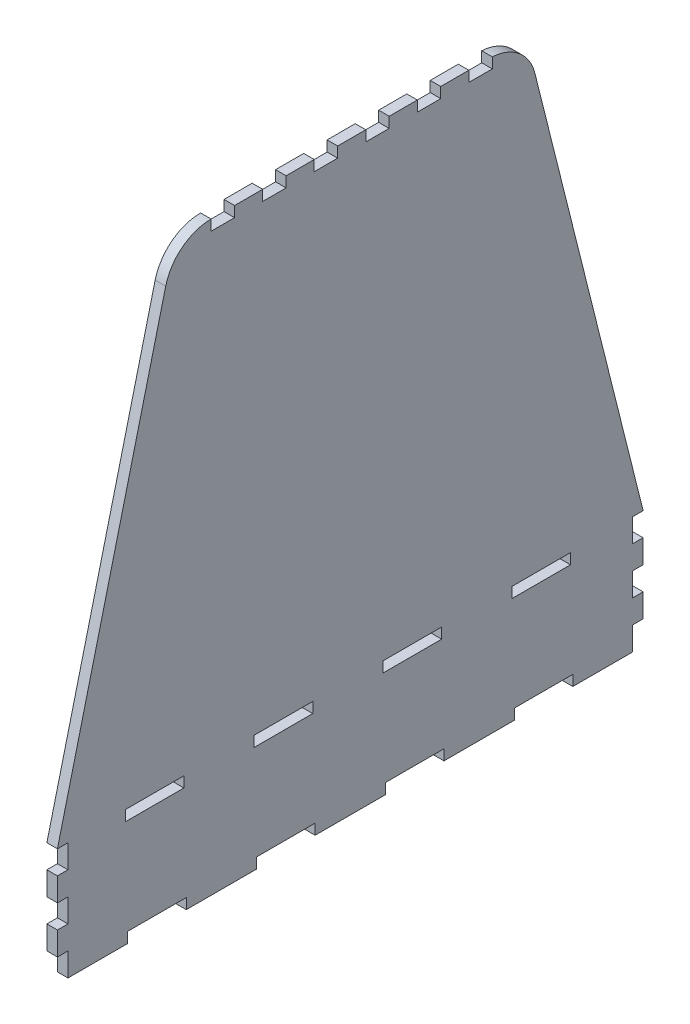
from build123d import *

# Parameters (mm, degrees)
BOSS_EXTRUDE1_DEPTH = 9
SKETCH5_W           = 50
SKETCH5_H           = 9
SKETCH5_W_2         = 20
CUT_EXTRUDE2_DEPTH  = 436.463985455
SKETCH4_W           = 9
SKETCH4_H           = 20
CUT_EXTRUDE3_DEPTH  = 436.463985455


with BuildPart() as part:
    # Sketch2 → Boss-Extrude1 (new body)
    with BuildSketch(Plane(origin=(0, 0, 0), x_dir=(0, 0, -1), z_dir=(1, 0, 0))):
        with BuildLine():
            Line((250, -256.43776824), (157.57464375, 113.263656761))
            ThreePointArc((157.57464375, 113.263656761), (143.38543212, 135.09044928), (118.768943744, 143.56223176))
            Line((118.768943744, 143.56223176), (-118.768943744, 143.56223176))
            ThreePointArc((-118.768943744, 143.56223176), (-143.38543212, 135.09044928), (-157.57464375, 113.263656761))
            Line((-157.57464375, 113.263656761), (-250, -256.43776824))
            Line((-250, -256.43776824), (-250, -356.43776824))
            Line((-250, -356.43776824), (250, -356.43776824))
            Line((250, -356.43776824), (250, -256.43776824))
        make_face()
    extrude(amount=BOSS_EXTRUDE1_DEPTH)

    # Sketch5 → Cut-Extrude2 (cut, through all)
    with BuildSketch(Plane.ZY):
        with Locations((-165, -351.93776824)):
            Rectangle(SKETCH5_W, SKETCH5_H)
        with Locations((-53, -260.93776824)):
            Rectangle(SKETCH5_W, SKETCH5_H)
        with Locations((-163, -260.93776824)):
            Rectangle(SKETCH5_W, SKETCH5_H)
        with Locations((-55, -351.93776824)):
            Rectangle(SKETCH5_W, SKETCH5_H)
        with Locations((57, -260.93776824)):
            Rectangle(SKETCH5_W, SKETCH5_H)
        with Locations((55, -351.93776824)):
            Rectangle(SKETCH5_W, SKETCH5_H)
        with Locations((167, -260.93776824)):
            Rectangle(SKETCH5_W, SKETCH5_H)
        with Locations((165, -351.93776824)):
            Rectangle(SKETCH5_W, SKETCH5_H)
        with Locations((64.768943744, 139.06223176)):
            Rectangle(SKETCH5_W_2, SKETCH5_H)
        with Locations((108.768943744, 139.06223176)):
            Rectangle(SKETCH5_W_2, SKETCH5_H)
        with Locations((20.768943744, 139.06223176)):
            Rectangle(SKETCH5_W_2, SKETCH5_H)
        with Locations((-23.231056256, 139.06223176)):
            Rectangle(SKETCH5_W_2, SKETCH5_H)
        with Locations((-67.231056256, 139.06223176)):
            Rectangle(SKETCH5_W_2, SKETCH5_H)
        with Locations((-111.231056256, 139.06223176)):
            Rectangle(SKETCH5_W_2, SKETCH5_H)
    extrude(amount=-CUT_EXTRUDE2_DEPTH, mode=Mode.SUBTRACT)

    # Sketch4 → Cut-Extrude3 (cut, through all)
    with BuildSketch(Plane(origin=(9, 0, 0), x_dir=(0, 0, -1), z_dir=(1, 0, 0))):
        with Locations((-245.5, -306.43776824)):
            Rectangle(SKETCH4_W, SKETCH4_H)
        with Locations((-245.5, -266.43776824)):
            Rectangle(SKETCH4_W, SKETCH4_H)
        with Locations((-245.5, -346.43776824)):
            Rectangle(SKETCH4_W, SKETCH4_H)
        with Locations((245.5, -266.43776824)):
            Rectangle(SKETCH4_W, SKETCH4_H)
        with Locations((245.5, -346.43776824)):
            Rectangle(SKETCH4_W, SKETCH4_H)
        with Locations((245.5, -306.43776824)):
            Rectangle(SKETCH4_W, SKETCH4_H)
    extrude(amount=-CUT_EXTRUDE3_DEPTH, mode=Mode.SUBTRACT)


solid = part.part
